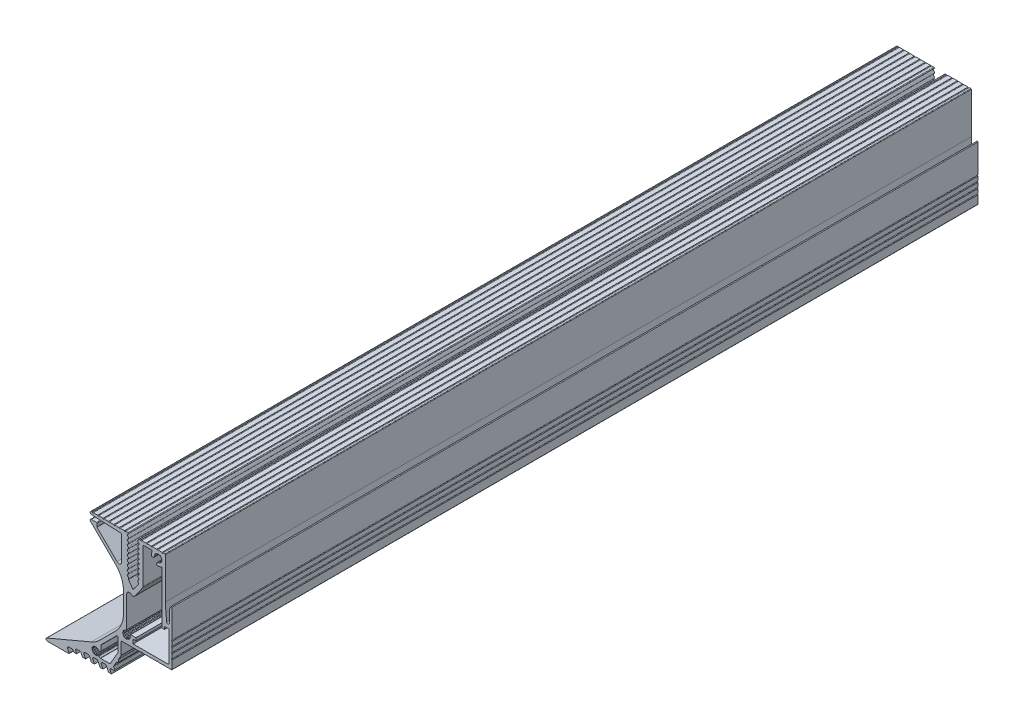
from build123d import *

# Parameters (mm, degrees)
EXTRUDE_1_DEPTH = 300


with BuildPart() as part:
    # Model → Extrude 1 (new body)
    with BuildSketch(Plane.XY):
        with BuildLine():
            Line((497.106271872, 2220.759608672), (497.909426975, 2220.759593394))
            ThreePointArc((497.909426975, 2220.759593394), (498.100190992, 2220.625958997), (498.03356057, 2220.402778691))
            ThreePointArc((498.03356057, 2220.402778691), (497.996123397, 2220.376104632), (497.956186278, 2220.353343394))
            ThreePointArc((497.956186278, 2220.353343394), (497.706017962, 2219.947093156), (497.956186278, 2219.540842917))
            ThreePointArc((497.956186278, 2219.540842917), (498.210730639, 2219.134592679), (497.956186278, 2218.72834244))
            ThreePointArc((497.956186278, 2218.72834244), (497.706186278, 2218.32209244), (497.956186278, 2217.91584244))
            ThreePointArc((497.956186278, 2217.91584244), (498.206211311, 2217.509592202), (497.956186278, 2217.103341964))
            ThreePointArc((497.956186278, 2217.103341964), (497.706186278, 2216.697091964), (497.956186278, 2216.290841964))
            ThreePointArc((497.956186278, 2216.290841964), (498.206206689, 2215.884591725), (497.956186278, 2215.478341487))
            ThreePointArc((497.956186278, 2215.478341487), (497.706186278, 2215.072091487), (497.956186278, 2214.665841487))
            ThreePointArc((497.956186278, 2214.665841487), (498.206193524, 2214.259591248), (497.956186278, 2213.85334101))
            ThreePointArc((497.956186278, 2213.85334101), (497.706186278, 2213.44709101), (497.956186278, 2213.04084101))
            ThreePointArc((497.956186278, 2213.04084101), (498.206200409, 2212.634590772), (497.956186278, 2212.228340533))
            ThreePointArc((497.956186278, 2212.228340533), (497.706186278, 2211.822090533), (497.956186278, 2211.415840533))
            ThreePointArc((497.956186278, 2211.415840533), (498.20620396, 2211.009590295), (497.956186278, 2210.603340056))
            ThreePointArc((497.956186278, 2210.603340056), (497.706186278, 2210.197090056), (497.956186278, 2209.790840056))
            ThreePointArc((497.956186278, 2209.790840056), (498.206264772, 2209.384589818), (497.956186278, 2208.97833958))
            ThreePointArc((497.956186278, 2208.97833958), (497.706186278, 2208.57208958), (497.956186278, 2208.16583958))
            ThreePointArc((497.956186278, 2208.16583958), (498.206197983, 2207.759589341), (497.956186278, 2207.353339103))
            ThreePointArc((497.956186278, 2207.353339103), (497.706186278, 2206.947089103), (497.956186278, 2206.540839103))
            ThreePointArc((497.956186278, 2206.540839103), (498.181217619, 2206.283305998), (498.163326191, 2205.941776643))
            ThreePointArc((498.163326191, 2205.941776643), (498.145197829, 2205.840193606), (498.18011907, 2205.743094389))
            Line((498.18011907, 2205.743094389), (499.737358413, 2203.496710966))
            ThreePointArc((499.737358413, 2203.496710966), (499.901726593, 2203.41065438), (500.066094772, 2203.496710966))
            Line((500.066094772, 2203.496710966), (501.960975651, 2206.230156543))
            ThreePointArc((501.960975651, 2206.230156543), (501.993446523, 2206.379677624), (501.910689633, 2206.508371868))
            ThreePointArc((501.910689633, 2206.508371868), (501.884004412, 2206.525556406), (501.856186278, 2206.540839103))
            ThreePointArc((501.856186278, 2206.540839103), (501.606172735, 2206.947089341), (501.856186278, 2207.35333958))
            ThreePointArc((501.856186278, 2207.35333958), (502.106186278, 2207.75958958), (501.856186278, 2208.16583958))
            ThreePointArc((501.856186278, 2208.16583958), (501.6061675, 2208.572089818), (501.856186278, 2208.978340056))
            ThreePointArc((501.856186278, 2208.978340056), (502.106186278, 2209.384590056), (501.856186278, 2209.790840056))
            ThreePointArc((501.856186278, 2209.790840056), (501.606139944, 2210.197090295), (501.856186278, 2210.603340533))
            ThreePointArc((501.856186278, 2210.603340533), (502.106186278, 2211.009590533), (501.856186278, 2211.415840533))
            ThreePointArc((501.856186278, 2211.415840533), (501.606173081, 2211.822090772), (501.856186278, 2212.22834101))
            ThreePointArc((501.856186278, 2212.22834101), (502.106186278, 2212.63459101), (501.856186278, 2213.04084101))
            ThreePointArc((501.856186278, 2213.04084101), (501.606148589, 2213.447091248), (501.856186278, 2213.853341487))
            ThreePointArc((501.856186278, 2213.853341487), (502.106186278, 2214.259591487), (501.856186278, 2214.665841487))
            ThreePointArc((501.856186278, 2214.665841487), (501.606183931, 2215.072091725), (501.856186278, 2215.478341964))
            ThreePointArc((501.856186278, 2215.478341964), (502.106186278, 2215.884591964), (501.856186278, 2216.290841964))
            ThreePointArc((501.856186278, 2216.290841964), (501.606180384, 2216.697092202), (501.856186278, 2217.10334244))
            ThreePointArc((501.856186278, 2217.10334244), (502.106186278, 2217.50959244), (501.856186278, 2217.91584244))
            ThreePointArc((501.856186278, 2217.91584244), (501.606153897, 2218.322092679), (501.856186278, 2218.728342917))
            ThreePointArc((501.856186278, 2218.728342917), (502.106186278, 2219.134592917), (501.856186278, 2219.540842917))
            ThreePointArc((501.856186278, 2219.540842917), (501.605270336, 2219.947093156), (501.856186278, 2220.353343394))
            ThreePointArc((501.856186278, 2220.353343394), (501.997173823, 2220.464069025), (502.084458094, 2220.620654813))
            ThreePointArc((502.084458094, 2220.620654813), (502.156981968, 2220.721242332), (502.274908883, 2220.759593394))
            Line((502.274908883, 2220.759593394), (502.680811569, 2220.759612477))
            ThreePointArc((502.680811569, 2220.759612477), (502.880811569, 2220.559612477), (503.080811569, 2220.759612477))
            Line((503.080811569, 2220.759612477), (504.680811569, 2220.759612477))
            ThreePointArc((504.680811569, 2220.759612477), (504.880811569, 2220.559612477), (505.080811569, 2220.759612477))
            Line((505.080811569, 2220.759612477), (506.680811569, 2220.759612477))
            ThreePointArc((506.680811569, 2220.759612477), (506.880811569, 2220.559612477), (507.080811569, 2220.759612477))
            Line((507.080811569, 2220.759612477), (508.680811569, 2220.759612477))
            ThreePointArc((508.680811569, 2220.759612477), (508.880811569, 2220.559612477), (509.080811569, 2220.759612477))
            Line((509.080811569, 2220.759612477), (510.684929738, 2220.759612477))
            ThreePointArc((510.684929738, 2220.759612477), (510.884929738, 2220.559612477), (511.084929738, 2220.759612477))
            Line((511.084929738, 2220.759612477), (511.664929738, 2220.759612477))
            ThreePointArc((511.664929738, 2220.759612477), (511.806351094, 2220.701033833), (511.864929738, 2220.559612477))
            Line((511.864929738, 2220.559612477), (511.864929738, 2205.326693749))
            Line((511.864929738, 2205.326693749), (511.865566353, 2205.310748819))
            Line((511.865566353, 2205.310748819), (512.352672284, 2199.220343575))
            ThreePointArc((512.352672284, 2199.220343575), (512.878217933, 2198.754226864), (513.364929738, 2199.260758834))
            Line((513.364929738, 2199.260758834), (513.364929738, 2203.547580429))
            ThreePointArc((513.364929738, 2203.547580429), (513.369377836, 2203.589526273), (513.382524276, 2203.629606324))
            Line((513.382524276, 2203.629606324), (513.982524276, 2204.963859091))
            ThreePointArc((513.982524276, 2204.963859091), (514.206875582, 2205.077385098), (514.364929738, 2204.881833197))
            Line((514.364929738, 2204.881833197), (514.364929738, 2194.291819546))
            ThreePointArc((514.364929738, 2194.291819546), (514.164929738, 2194.091819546), (514.364929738, 2193.891819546))
            Line((514.364929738, 2193.891819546), (514.364929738, 2192.291819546))
            ThreePointArc((514.364929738, 2192.291819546), (514.164929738, 2192.091819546), (514.364929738, 2191.891819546))
            Line((514.364929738, 2191.891819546), (514.364929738, 2190.291819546))
            ThreePointArc((514.364929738, 2190.291819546), (514.164929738, 2190.091819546), (514.364929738, 2189.891819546))
            Line((514.364929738, 2189.891819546), (514.364929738, 2188.291819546))
            ThreePointArc((514.364929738, 2188.291819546), (514.164929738, 2188.091819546), (514.364929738, 2187.891819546))
            Line((514.364929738, 2187.891819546), (514.364929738, 2184.840502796))
            ThreePointArc((514.364929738, 2184.840502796), (514.306351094, 2184.699081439), (514.164929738, 2184.640502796))
            Line((514.164929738, 2184.640502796), (511.238612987, 2184.640502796))
            ThreePointArc((511.238612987, 2184.640502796), (511.038612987, 2184.840502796), (510.838612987, 2184.640502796))
            Line((510.838612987, 2184.640502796), (509.238612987, 2184.640502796))
            ThreePointArc((509.238612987, 2184.640502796), (509.038612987, 2184.840502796), (508.838612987, 2184.640502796))
            Line((508.838612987, 2184.640502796), (507.238612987, 2184.640502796))
            ThreePointArc((507.238612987, 2184.640502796), (507.038612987, 2184.840502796), (506.838612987, 2184.640502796))
            Line((506.838612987, 2184.640502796), (505.238612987, 2184.640502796))
            ThreePointArc((505.238612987, 2184.640502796), (505.038612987, 2184.840502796), (504.838612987, 2184.640502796))
            Line((504.838612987, 2184.640502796), (503.238612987, 2184.640502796))
            ThreePointArc((503.238612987, 2184.640502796), (503.038612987, 2184.840502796), (502.838612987, 2184.640502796))
            Line((502.838612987, 2184.640502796), (495.670571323, 2184.640502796))
            ThreePointArc((495.670571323, 2184.640502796), (495.529149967, 2184.581924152), (495.470571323, 2184.440502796))
            Line((495.470571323, 2184.440502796), (495.470571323, 2180.002234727))
            ThreePointArc((495.470571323, 2180.002234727), (495.463756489, 2179.950470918), (495.443776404, 2179.902234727))
            Line((495.443776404, 2179.902234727), (494.443511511, 2178.169725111))
            ThreePointArc((494.443511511, 2178.169725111), (494.376608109, 2177.928884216), (494.434644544, 2177.685754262))
            ThreePointArc((494.434644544, 2177.685754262), (494.425777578, 2177.201783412), (494.01108001, 2176.952118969))
            ThreePointArc((494.01108001, 2176.952118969), (493.771505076, 2176.880815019), (493.596382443, 2176.702454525))
            Line((493.596382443, 2176.702454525), (492.74010414, 2175.219337))
            ThreePointArc((492.74010414, 2175.219337), (492.673592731, 2174.991146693), (492.719962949, 2174.758027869))
            Line((492.719962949, 2174.758027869), (492.950545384, 2174.26354224))
            ThreePointArc((492.950545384, 2174.26354224), (492.796987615, 2173.65193052), (492.166893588, 2173.677038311))
            ThreePointArc((492.166893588, 2173.677038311), (491.536799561, 2173.702146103), (491.383241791, 2173.090534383))
            Line((491.383241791, 2173.090534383), (491.826248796, 2172.140502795))
            Line((491.826248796, 2172.140502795), (490.722870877, 2172.140502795))
            Line((490.722870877, 2172.140502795), (489.924703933, 2173.85217733))
            ThreePointArc((489.924703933, 2173.85217733), (489.740199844, 2174.062563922), (489.47155004, 2174.140868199))
            Line((489.47155004, 2174.140868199), (488.509305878, 2174.140868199))
            ThreePointArc((488.509305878, 2174.140868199), (488.087610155, 2173.909518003), (488.056151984, 2173.429559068))
            Line((488.056151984, 2173.429559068), (488.657248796, 2172.140502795))
            Line((488.657248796, 2172.140502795), (487.553870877, 2172.140502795))
            Line((487.553870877, 2172.140502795), (486.755703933, 2173.85217733))
            ThreePointArc((486.755703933, 2173.85217733), (486.571199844, 2174.062563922), (486.30255004, 2174.140868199))
            Line((486.30255004, 2174.140868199), (485.340305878, 2174.140868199))
            ThreePointArc((485.340305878, 2174.140868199), (484.918610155, 2173.909518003), (484.887151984, 2173.429559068))
            Line((484.887151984, 2173.429559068), (485.488248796, 2172.140502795))
            Line((485.488248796, 2172.140502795), (484.384870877, 2172.140502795))
            Line((484.384870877, 2172.140502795), (483.586703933, 2173.85217733))
            ThreePointArc((483.586703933, 2173.85217733), (483.402199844, 2174.062563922), (483.13355004, 2174.140868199))
            Line((483.13355004, 2174.140868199), (482.030172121, 2174.140868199))
            ThreePointArc((482.030172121, 2174.140868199), (481.608476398, 2173.909518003), (481.577018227, 2173.429559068))
            Line((481.577018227, 2173.429559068), (482.178115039, 2172.140502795))
            Line((482.178115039, 2172.140502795), (481.07473712, 2172.140502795))
            Line((481.07473712, 2172.140502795), (480.504510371, 2173.363358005))
            ThreePointArc((480.504510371, 2173.363358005), (480.320006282, 2173.573744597), (480.051356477, 2173.652048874))
            Line((480.051356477, 2173.652048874), (478.947978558, 2173.652048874))
            ThreePointArc((478.947978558, 2173.652048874), (478.526282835, 2173.420698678), (478.494824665, 2172.940739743))
            Line((478.494824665, 2172.940739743), (478.867981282, 2172.140502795))
            Line((478.867981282, 2172.140502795), (477.764603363, 2172.140502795))
            Line((477.764603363, 2172.140502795), (477.54679937, 2172.607584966))
            ThreePointArc((477.54679937, 2172.607584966), (477.362295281, 2172.817971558), (477.093645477, 2172.896275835))
            Line((477.093645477, 2172.896275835), (475.990267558, 2172.896275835))
            ThreePointArc((475.990267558, 2172.896275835), (475.568571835, 2172.664925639), (475.537113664, 2172.184966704))
            Line((475.537113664, 2172.184966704), (476.071182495, 2171.039652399))
            ThreePointArc((476.071182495, 2171.039652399), (476.058599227, 2170.847668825), (475.889920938, 2170.755128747))
            Line((475.889920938, 2170.755128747), (467.961097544, 2170.755128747))
            ThreePointArc((467.961097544, 2170.755128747), (467.480391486, 2171.147994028), (467.76968594, 2171.697293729))
            Line((467.76968594, 2171.697293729), (484.31747535, 2178.710506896))
            ThreePointArc((484.31747535, 2178.710506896), (486.004919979, 2179.625799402), (487.486374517, 2180.846668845))
            Line((487.486374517, 2180.846668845), (493.37599755, 2186.736291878))
            ThreePointArc((493.37599755, 2186.736291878), (495.543725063, 2189.980525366), (496.304929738, 2193.80735969))
            Line((496.304929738, 2193.80735969), (496.304929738, 2201.150072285))
            ThreePointArc((496.304929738, 2201.150072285), (495.529080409, 2205.012072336), (493.321920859, 2208.274806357))
            Line((493.321920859, 2208.274806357), (484.055422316, 2217.401173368))
            ThreePointArc((484.055422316, 2217.401173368), (483.947685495, 2217.956654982), (484.427245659, 2218.256969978))
            Line((484.427245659, 2218.256969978), (486.214661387, 2218.181926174))
            ThreePointArc((486.214661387, 2218.181926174), (486.3506289, 2218.120525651), (486.406271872, 2217.982102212))
            Line((486.406271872, 2217.982102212), (486.406271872, 2216.853884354))
            ThreePointArc((486.406271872, 2216.853884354), (486.421788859, 2216.776644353), (486.46593205, 2216.711389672))
            Line((486.46593205, 2216.711389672), (493.903230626, 2209.386560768))
            ThreePointArc((493.903230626, 2209.386560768), (494.991129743, 2209.176619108), (495.604929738, 2210.099034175))
            Line((495.604929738, 2210.099034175), (495.604929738, 2219.097222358))
            ThreePointArc((495.604929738, 2219.097222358), (495.549286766, 2219.235645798), (495.413319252, 2219.297046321))
            Line((495.413319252, 2219.297046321), (484.385298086, 2219.76005257))
            ThreePointArc((484.385298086, 2219.76005257), (483.906381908, 2220.270101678), (484.406271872, 2220.759612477))
            Line((484.406271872, 2220.759612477), (484.706271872, 2220.759612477))
            ThreePointArc((484.706271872, 2220.759612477), (484.906271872, 2220.559612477), (485.106271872, 2220.759612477))
            Line((485.106271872, 2220.759612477), (486.706271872, 2220.759612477))
            ThreePointArc((486.706271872, 2220.759612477), (486.906271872, 2220.559612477), (487.106271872, 2220.759612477))
            Line((487.106271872, 2220.759612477), (488.706271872, 2220.759612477))
            ThreePointArc((488.706271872, 2220.759612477), (488.906271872, 2220.559612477), (489.106271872, 2220.759612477))
            Line((489.106271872, 2220.759612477), (490.706271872, 2220.759612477))
            ThreePointArc((490.706271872, 2220.759612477), (490.906271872, 2220.559612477), (491.106271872, 2220.759612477))
            Line((491.106271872, 2220.759612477), (492.706271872, 2220.759612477))
            ThreePointArc((492.706271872, 2220.759612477), (492.906271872, 2220.559612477), (493.106271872, 2220.759612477))
            Line((493.106271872, 2220.759612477), (494.706271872, 2220.759612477))
            ThreePointArc((494.706271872, 2220.759612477), (494.906271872, 2220.559612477), (495.106271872, 2220.759612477))
            Line((495.106271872, 2220.759612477), (496.706271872, 2220.759612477))
            ThreePointArc((496.706271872, 2220.759612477), (496.90626997, 2220.559600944), (497.106271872, 2220.759608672))
        make_face()
        with BuildLine():
            Line((487.956771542, 2179.620009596), (493.758439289, 2185.421677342))
            ThreePointArc((493.758439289, 2185.421677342), (494.085376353, 2185.486709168), (494.270571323, 2185.209545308))
            Line((494.270571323, 2185.209545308), (494.270571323, 2180.404158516))
            ThreePointArc((494.270571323, 2180.404158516), (494.253534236, 2180.274748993), (494.203584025, 2180.154158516))
            Line((494.203584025, 2180.154158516), (491.453497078, 2175.390868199))
            ThreePointArc((491.453497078, 2175.390868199), (491.270484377, 2175.207855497), (491.020484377, 2175.140868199))
            Line((491.020484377, 2175.140868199), (487.784515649, 2175.140868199))
            ThreePointArc((487.784515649, 2175.140868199), (487.71611162, 2175.152929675), (487.655958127, 2175.18765931))
            Line((487.655958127, 2175.18765931), (487.21907756, 2175.554245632))
            ThreePointArc((487.21907756, 2175.554245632), (487.079199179, 2175.600716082), (486.945469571, 2175.538733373))
            ThreePointArc((486.945469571, 2175.538733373), (486.860237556, 2175.493844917), (486.765272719, 2175.51000504))
            ThreePointArc((486.765272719, 2175.51000504), (486.582334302, 2175.508704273), (486.485288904, 2175.353622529))
            ThreePointArc((486.485288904, 2175.353622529), (486.377641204, 2175.218044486), (486.213852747, 2175.27410494))
            ThreePointArc((486.213852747, 2175.27410494), (486.048466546, 2175.352306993), (485.893744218, 2175.254689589))
            ThreePointArc((485.893744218, 2175.254689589), (485.737940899, 2175.179299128), (485.614687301, 2175.300818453))
            ThreePointArc((485.614687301, 2175.300818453), (485.499610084, 2175.443034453), (485.317855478, 2175.422215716))
            ThreePointArc((485.317855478, 2175.422215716), (485.144739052, 2175.421846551), (485.086448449, 2175.584854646))
            ThreePointArc((485.086448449, 2175.584854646), (485.044476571, 2175.762920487), (484.871684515, 2175.823020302))
            ThreePointArc((484.871684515, 2175.823020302), (484.7156001, 2175.897827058), (484.733760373, 2176.069956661))
            ThreePointArc((484.733760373, 2176.069956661), (484.77320489, 2176.248599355), (484.643600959, 2176.37771908))
            ThreePointArc((484.643600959, 2176.37771908), (484.535431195, 2176.512840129), (484.626477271, 2176.660044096))
            ThreePointArc((484.626477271, 2176.660044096), (484.739525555, 2176.803881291), (484.678779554, 2176.976447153))
            ThreePointArc((484.678779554, 2176.976447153), (484.63994151, 2177.14512309), (484.785847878, 2177.238242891))
            ThreePointArc((484.785847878, 2177.238242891), (484.950109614, 2177.318785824), (484.970252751, 2177.500619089))
            ThreePointArc((484.970252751, 2177.500619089), (485.008451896, 2177.669436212), (485.180306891, 2177.690033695))
            ThreePointArc((485.180306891, 2177.690033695), (485.363249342, 2177.691327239), (485.460290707, 2177.846416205))
            ThreePointArc((485.460290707, 2177.846416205), (485.568435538, 2177.982125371), (485.732329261, 2177.925106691))
            ThreePointArc((485.732329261, 2177.925106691), (485.897624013, 2177.847758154), (486.051835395, 2177.945349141))
            ThreePointArc((486.051835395, 2177.945349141), (486.207638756, 2178.020739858), (486.330892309, 2177.899220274))
            ThreePointArc((486.330892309, 2177.899220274), (486.445967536, 2177.756999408), (486.627724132, 2177.777823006))
            ThreePointArc((486.627724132, 2177.777823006), (486.800808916, 2177.778147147), (486.859131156, 2177.615184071))
            ThreePointArc((486.859131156, 2177.615184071), (486.901100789, 2177.437116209), (487.073895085, 2177.377018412))
            ThreePointArc((487.073895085, 2177.377018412), (487.167815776, 2177.362380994), (487.234112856, 2177.294263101))
            ThreePointArc((487.234112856, 2177.294263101), (487.341274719, 2177.194977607), (487.487361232, 2177.195049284))
            Line((487.487361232, 2177.195049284), (487.742035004, 2177.2951012))
            ThreePointArc((487.742035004, 2177.2951012), (487.83417046, 2177.368615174), (487.868903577, 2177.481251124))
            Line((487.868903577, 2177.481251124), (487.868903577, 2179.407877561))
            ThreePointArc((487.868903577, 2179.407877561), (487.891739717, 2179.522682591), (487.956771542, 2179.620009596))
        make_face(mode=Mode.SUBTRACT)
        with BuildLine():
            Line((503.801727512, 2219.559612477), (506.826563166, 2219.559612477))
            ThreePointArc((506.826563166, 2219.559612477), (506.997401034, 2219.463604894), (507.004221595, 2219.267756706))
            ThreePointArc((507.004221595, 2219.267756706), (506.75065141, 2218.477102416), (506.770019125, 2217.647007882))
            ThreePointArc((506.770019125, 2217.647007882), (506.861585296, 2217.514485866), (507.021149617, 2217.492447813))
            Line((507.021149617, 2217.492447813), (507.661433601, 2217.674636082))
            ThreePointArc((507.661433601, 2217.674636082), (507.780361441, 2217.767674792), (507.800254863, 2217.917355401))
            ThreePointArc((507.800254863, 2217.917355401), (507.808684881, 2218.016830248), (507.877653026, 2218.089008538))
            ThreePointArc((507.877653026, 2218.089008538), (507.980786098, 2218.240113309), (507.908587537, 2218.408209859))
            ThreePointArc((507.908587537, 2218.408209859), (507.858516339, 2218.573894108), (507.997831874, 2218.676605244))
            ThreePointArc((507.997831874, 2218.676605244), (508.156313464, 2218.767998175), (508.164199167, 2218.950773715))
            ThreePointArc((508.164199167, 2218.950773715), (508.190974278, 2219.121775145), (508.361057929, 2219.153867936))
            ThreePointArc((508.361057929, 2219.153867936), (508.543498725, 2219.16744767), (508.629906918, 2219.328701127))
            ThreePointArc((508.629906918, 2219.328701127), (508.728222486, 2219.471158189), (508.895389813, 2219.426268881))
            ThreePointArc((508.895389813, 2219.426268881), (509.06565534, 2219.359345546), (509.213471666, 2219.46713894))
            ThreePointArc((509.213471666, 2219.46713894), (509.363859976, 2219.552822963), (509.494996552, 2219.439855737))
            ThreePointArc((509.494996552, 2219.439855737), (509.619362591, 2219.305681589), (509.799311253, 2219.338667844))
            ThreePointArc((509.799311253, 2219.338667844), (509.971983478, 2219.350615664), (510.041118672, 2219.191937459))
            ThreePointArc((510.041118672, 2219.191937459), (510.094952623, 2219.017090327), (510.271392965, 2218.96873312))
            ThreePointArc((510.271392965, 2218.96873312), (510.43214901, 2218.904577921), (510.425589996, 2218.731617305))
            ThreePointArc((510.425589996, 2218.731617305), (510.398232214, 2218.550728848), (510.536215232, 2218.430604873))
            ThreePointArc((510.536215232, 2218.430604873), (510.653223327, 2218.303054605), (510.572261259, 2218.150067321))
            ThreePointArc((510.572261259, 2218.150067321), (510.469128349, 2217.998962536), (510.541326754, 2217.830866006))
            ThreePointArc((510.541326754, 2217.830866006), (510.591397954, 2217.665181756), (510.45208242, 2217.562470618))
            ThreePointArc((510.45208242, 2217.562470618), (510.293600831, 2217.471077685), (510.28571513, 2217.288302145))
            ThreePointArc((510.28571513, 2217.288302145), (510.258940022, 2217.117300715), (510.088856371, 2217.085207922))
            ThreePointArc((510.088856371, 2217.085207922), (509.906415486, 2217.071628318), (509.82000738, 2216.910374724))
            ThreePointArc((509.82000738, 2216.910374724), (509.721708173, 2216.767873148), (509.554524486, 2216.812806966))
            ThreePointArc((509.554524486, 2216.812806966), (509.384259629, 2216.879725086), (509.236442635, 2216.771936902))
            ThreePointArc((509.236442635, 2216.771936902), (509.16634694, 2216.70074598), (509.067094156, 2216.689325))
            ThreePointArc((509.067094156, 2216.689325), (508.918022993, 2216.664868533), (508.828579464, 2216.543130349))
            Line((508.828579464, 2216.543130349), (508.666196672, 2215.897452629))
            ThreePointArc((508.666196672, 2215.897452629), (508.692812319, 2215.738419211), (508.828435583, 2215.651204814))
            ThreePointArc((508.828435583, 2215.651204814), (509.620605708, 2215.651093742), (510.372564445, 2215.900275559))
            ThreePointArc((510.372564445, 2215.900275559), (510.568676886, 2215.893868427), (510.664929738, 2215.722881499))
            Line((510.664929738, 2215.722881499), (510.664929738, 2196.54185169))
            ThreePointArc((510.664929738, 2196.54185169), (510.723508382, 2196.400430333), (510.864929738, 2196.34185169))
            Line((510.864929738, 2196.34185169), (511.464929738, 2196.34185169))
            ThreePointArc((511.464929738, 2196.34185169), (511.606351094, 2196.400430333), (511.664929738, 2196.54185169))
            Line((511.664929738, 2196.54185169), (511.664929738, 2197.34185169))
            Line((511.664929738, 2197.34185169), (513.164929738, 2197.34185169))
            Line((513.164929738, 2197.34185169), (513.164929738, 2186.040502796))
            ThreePointArc((513.164929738, 2186.040502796), (513.106351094, 2185.899081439), (512.964929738, 2185.840502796))
            Line((512.964929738, 2185.840502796), (499.911032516, 2185.840502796))
            Line((499.911032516, 2185.840502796), (499.911032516, 2187.340502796))
            Line((499.911032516, 2187.340502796), (500.911032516, 2187.340502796))
            Line((500.911032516, 2187.340502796), (500.911032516, 2188.340502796))
            Line((500.911032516, 2188.340502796), (498.951940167, 2188.340502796))
            ThreePointArc((498.951940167, 2188.340502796), (498.785519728, 2188.251427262), (498.767339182, 2188.063545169))
            ThreePointArc((498.767339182, 2188.063545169), (498.774265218, 2187.968797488), (498.722916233, 2187.888870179))
            ThreePointArc((498.722916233, 2187.888870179), (498.653250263, 2187.719711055), (498.758631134, 2187.570168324))
            ThreePointArc((498.758631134, 2187.570168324), (498.841924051, 2187.418406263), (498.726793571, 2187.289122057))
            ThreePointArc((498.726793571, 2187.289122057), (498.590626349, 2187.166943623), (498.620692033, 2186.986485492))
            ThreePointArc((498.620692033, 2186.986485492), (498.629842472, 2186.813642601), (498.470065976, 2186.747085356))
            ThreePointArc((498.470065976, 2186.747085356), (498.294372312, 2186.696087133), (498.243162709, 2186.520454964))
            ThreePointArc((498.243162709, 2186.520454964), (498.17641325, 2186.360758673), (498.003581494, 2186.37011709))
            ThreePointArc((498.003581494, 2186.37011709), (497.823159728, 2186.400399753), (497.700817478, 2186.264379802))
            ThreePointArc((497.700817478, 2186.264379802), (497.571389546, 2186.149452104), (497.419733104, 2186.232880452))
            ThreePointArc((497.419733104, 2186.232880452), (497.27031788, 2186.338446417), (497.101074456, 2186.26897883))
            ThreePointArc((497.101074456, 2186.26897883), (496.934601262, 2186.221596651), (496.83415913, 2186.362556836))
            ThreePointArc((496.83415913, 2186.362556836), (496.745345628, 2186.522499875), (496.562720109, 2186.533341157))
            ThreePointArc((496.562720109, 2186.533341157), (496.3921744, 2186.562881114), (496.362839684, 2186.733462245))
            ThreePointArc((496.362839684, 2186.733462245), (496.352218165, 2186.916100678), (496.192382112, 2187.005106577))
            ThreePointArc((496.192382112, 2187.005106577), (496.051542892, 2187.105718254), (496.099125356, 2187.272134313))
            ThreePointArc((496.099125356, 2187.272134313), (496.168796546, 2187.441294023), (496.06341045, 2187.590836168))
            ThreePointArc((496.06341045, 2187.590836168), (495.980164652, 2187.742592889), (496.095248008, 2187.871882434))
            ThreePointArc((496.095248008, 2187.871882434), (496.231415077, 2187.994060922), (496.20134954, 2188.174518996))
            ThreePointArc((496.20134954, 2188.174518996), (496.1921991, 2188.347361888), (496.351975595, 2188.413919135))
            ThreePointArc((496.351975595, 2188.413919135), (496.527669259, 2188.46491736), (496.578878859, 2188.64054953))
            ThreePointArc((496.578878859, 2188.64054953), (496.645628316, 2188.800245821), (496.818460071, 2188.790887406))
            ThreePointArc((496.818460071, 2188.790887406), (496.998881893, 2188.760604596), (497.121224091, 2188.896624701))
            ThreePointArc((497.121224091, 2188.896624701), (497.179310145, 2188.983989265), (497.280423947, 2189.011963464))
            ThreePointArc((497.280423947, 2189.011963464), (497.432982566, 2189.063730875), (497.497832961, 2189.211204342))
            Line((497.497832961, 2189.211204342), (497.504929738, 2200.762241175))
            ThreePointArc((497.504929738, 2200.762241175), (498.091780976, 2201.672904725), (499.163545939, 2201.514720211))
            ThreePointArc((499.163545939, 2201.514720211), (499.944681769, 2201.274733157), (500.644003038, 2201.697482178))
            Line((500.644003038, 2201.697482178), (503.42356841, 2205.707122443))
            ThreePointArc((503.42356841, 2205.707122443), (503.556149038, 2205.978377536), (503.601727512, 2206.276839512))
            Line((503.601727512, 2206.276839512), (503.601727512, 2219.359612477))
            ThreePointArc((503.601727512, 2219.359612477), (503.660306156, 2219.501033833), (503.801727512, 2219.559612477))
        make_face(mode=Mode.SUBTRACT)
    extrude(amount=EXTRUDE_1_DEPTH)


solid = part.part
